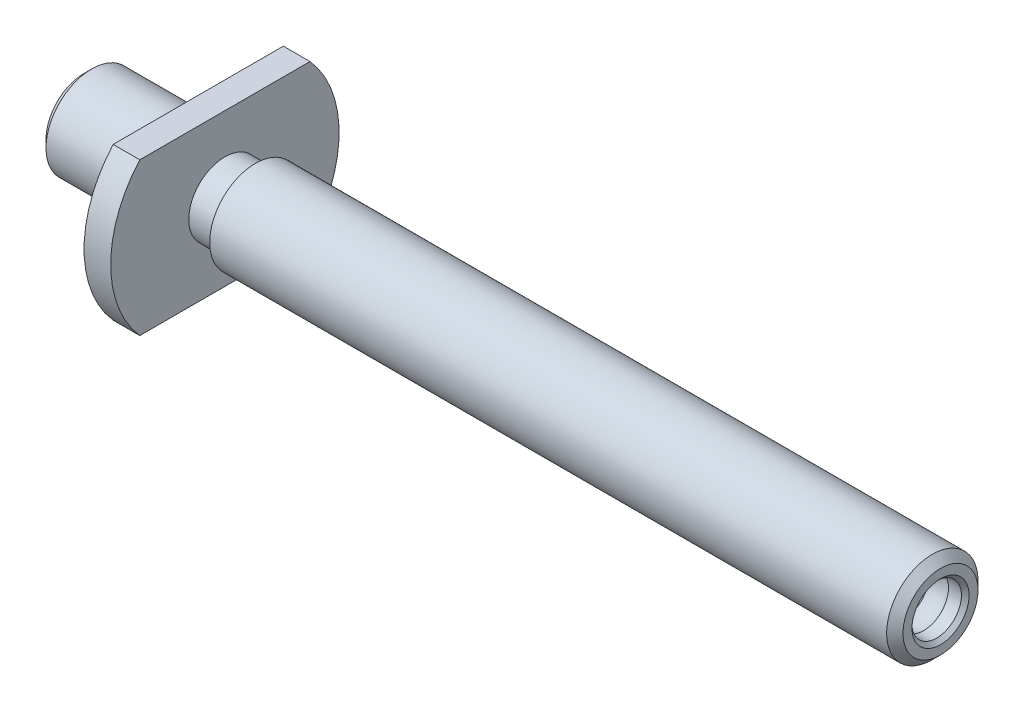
ISO-10303-21;
HEADER;
FILE_DESCRIPTION(('STEP AP214'),'2;1');
FILE_NAME('part.step','',(''),(''),'','','');
FILE_SCHEMA(('AUTOMOTIVE_DESIGN { 1 0 10303 214 1 1 1 1 }'));
ENDSEC;
DATA;
#1=APPLICATION_CONTEXT('core data for automotive mechanical design processes');
#2=APPLICATION_PROTOCOL_DEFINITION('international standard','automotive_design',2000,#1);
#3=PRODUCT_CONTEXT('',#1,'mechanical');
#4=PRODUCT('Part','Part','',(#3));
#5=PRODUCT_RELATED_PRODUCT_CATEGORY('part','',(#4));
#6=PRODUCT_DEFINITION_FORMATION('','',#4);
#7=PRODUCT_DEFINITION_CONTEXT('part definition',#1,'design');
#8=PRODUCT_DEFINITION('design','',#6,#7);
#9=PRODUCT_DEFINITION_SHAPE('','',#8);
#10=(LENGTH_UNIT() NAMED_UNIT(*) SI_UNIT(.MILLI.,.METRE.));
#11=(NAMED_UNIT(*) PLANE_ANGLE_UNIT() SI_UNIT($,.RADIAN.));
#12=(NAMED_UNIT(*) SI_UNIT($,.STERADIAN.) SOLID_ANGLE_UNIT());
#13=UNCERTAINTY_MEASURE_WITH_UNIT(LENGTH_MEASURE(1.E-05),#10,'distance_accuracy_value','');
#14=(GEOMETRIC_REPRESENTATION_CONTEXT(3) GLOBAL_UNCERTAINTY_ASSIGNED_CONTEXT((#13)) GLOBAL_UNIT_ASSIGNED_CONTEXT((#10,
#11,#12)) REPRESENTATION_CONTEXT('',''));
#15=CARTESIAN_POINT('',(0.,0.,0.));
#16=DIRECTION('',(0.,0.,1.));
#17=DIRECTION('',(1.,0.,0.));
#18=AXIS2_PLACEMENT_3D('',#15,#16,#17);
#19=CARTESIAN_POINT('',(110.6665317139,0.,0.));
#20=DIRECTION('',(1.,0.,0.));
#21=DIRECTION('',(0.,0.,-1.));
#22=AXIS2_PLACEMENT_3D('',#19,#20,#21);
#23=CYLINDRICAL_SURFACE('',#22,15.);
#24=DIRECTION('',(1.,0.,0.));
#25=VECTOR('',#24,1.);
#26=CARTESIAN_POINT('',(110.6665317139,-10.,11.1803398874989));
#27=LINE('',#26,#25);
#28=CARTESIAN_POINT('',(3.5,-10.,11.1803398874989));
#29=VERTEX_POINT('',#28);
#30=CARTESIAN_POINT('',(0.,-10.,11.1803398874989));
#31=VERTEX_POINT('',#30);
#32=EDGE_CURVE('E57',#29,#31,#27,.F.);
#33=ORIENTED_EDGE('',*,*,#32,.F.);
#34=CARTESIAN_POINT('',(3.5,0.,0.));
#35=DIRECTION('',(1.,0.,0.));
#36=DIRECTION('',(0.,0.,-1.));
#37=AXIS2_PLACEMENT_3D('',#34,#35,#36);
#38=CIRCLE('',#37,15.);
#39=CARTESIAN_POINT('',(3.5,10.,11.1803398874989));
#40=VERTEX_POINT('',#39);
#41=EDGE_CURVE('E110',#40,#29,#38,.T.);
#42=ORIENTED_EDGE('',*,*,#41,.F.);
#43=DIRECTION('',(1.,0.,0.));
#44=VECTOR('',#43,1.);
#45=CARTESIAN_POINT('',(110.6665317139,10.,11.1803398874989));
#46=LINE('',#45,#44);
#47=CARTESIAN_POINT('',(0.,10.,11.1803398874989));
#48=VERTEX_POINT('',#47);
#49=EDGE_CURVE('E102',#40,#48,#46,.F.);
#50=ORIENTED_EDGE('',*,*,#49,.T.);
#51=CARTESIAN_POINT('',(0.,0.,0.));
#52=DIRECTION('',(1.,0.,0.));
#53=DIRECTION('',(0.,0.,-1.));
#54=AXIS2_PLACEMENT_3D('',#51,#52,#53);
#55=CIRCLE('',#54,15.);
#56=EDGE_CURVE('E87',#48,#31,#55,.T.);
#57=ORIENTED_EDGE('',*,*,#56,.T.);
#58=EDGE_LOOP('',(#33,#42,#50,#57));
#59=FACE_BOUND('',#58,.T.);
#60=ADVANCED_FACE('F34',(#59),#23,.T.);
#61=CARTESIAN_POINT('',(3.5,4.75,0.));
#62=DIRECTION('',(1.,0.,0.));
#63=DIRECTION('',(0.,0.,-1.));
#64=AXIS2_PLACEMENT_3D('',#61,#62,#63);
#65=PLANE('',#64);
#66=DIRECTION('',(0.,0.,1.));
#67=VECTOR('',#66,1.);
#68=CARTESIAN_POINT('',(3.5,-10.,0.));
#69=LINE('',#68,#67);
#70=CARTESIAN_POINT('',(3.5,-10.,-11.1803398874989));
#71=VERTEX_POINT('',#70);
#72=EDGE_CURVE('E49',#71,#29,#69,.T.);
#73=ORIENTED_EDGE('',*,*,#72,.F.);
#74=CARTESIAN_POINT('',(3.5,10.,-11.1803398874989));
#75=VERTEX_POINT('',#74);
#76=EDGE_CURVE('E93',#71,#75,#38,.T.);
#77=ORIENTED_EDGE('',*,*,#76,.T.);
#78=DIRECTION('',(0.,0.,1.));
#79=VECTOR('',#78,1.);
#80=CARTESIAN_POINT('',(3.5,10.,0.));
#81=LINE('',#80,#79);
#82=EDGE_CURVE('E105',#75,#40,#81,.T.);
#83=ORIENTED_EDGE('',*,*,#82,.T.);
#84=ORIENTED_EDGE('',*,*,#41,.T.);
#85=EDGE_LOOP('',(#73,#77,#83,#84));
#86=FACE_BOUND('',#85,.T.);
#87=CARTESIAN_POINT('',(3.5,0.,0.));
#88=DIRECTION('',(1.,0.,0.));
#89=DIRECTION('',(0.,0.,-1.));
#90=AXIS2_PLACEMENT_3D('',#87,#88,#89);
#91=CIRCLE('',#90,4.75);
#92=CARTESIAN_POINT('',(3.5,0.,-4.75));
#93=VERTEX_POINT('',#92);
#94=EDGE_CURVE('E112',#93,#93,#91,.T.);
#95=ORIENTED_EDGE('',*,*,#94,.F.);
#96=EDGE_LOOP('',(#95));
#97=FACE_BOUND('',#96,.T.);
#98=ADVANCED_FACE('F170',(#86,#97),#65,.T.);
#99=DIRECTION('',(1.,0.,0.));
#100=VECTOR('',#99,1.);
#101=CARTESIAN_POINT('',(110.6665317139,-10.,-11.1803398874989));
#102=LINE('',#101,#100);
#103=CARTESIAN_POINT('',(0.,-10.,-11.1803398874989));
#104=VERTEX_POINT('',#103);
#105=EDGE_CURVE('E91',#104,#71,#102,.T.);
#106=ORIENTED_EDGE('',*,*,#105,.F.);
#107=CARTESIAN_POINT('',(0.,10.,-11.1803398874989));
#108=VERTEX_POINT('',#107);
#109=EDGE_CURVE('E79',#104,#108,#55,.T.);
#110=ORIENTED_EDGE('',*,*,#109,.T.);
#111=DIRECTION('',(1.,0.,0.));
#112=VECTOR('',#111,1.);
#113=CARTESIAN_POINT('',(110.6665317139,10.,-11.1803398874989));
#114=LINE('',#113,#112);
#115=EDGE_CURVE('E98',#108,#75,#114,.T.);
#116=ORIENTED_EDGE('',*,*,#115,.T.);
#117=ORIENTED_EDGE('',*,*,#76,.F.);
#118=EDGE_LOOP('',(#106,#110,#116,#117));
#119=FACE_BOUND('',#118,.T.);
#120=ADVANCED_FACE('F92',(#119),#23,.T.);
#121=CARTESIAN_POINT('',(0.,15.,0.));
#122=DIRECTION('',(-1.,0.,0.));
#123=DIRECTION('',(0.,0.,1.));
#124=AXIS2_PLACEMENT_3D('',#121,#122,#123);
#125=PLANE('',#124);
#126=DIRECTION('',(0.,0.,-1.));
#127=VECTOR('',#126,1.);
#128=CARTESIAN_POINT('',(0.,-10.,0.));
#129=LINE('',#128,#127);
#130=EDGE_CURVE('E11',#31,#104,#129,.T.);
#131=ORIENTED_EDGE('',*,*,#130,.F.);
#132=ORIENTED_EDGE('',*,*,#56,.F.);
#133=DIRECTION('',(0.,0.,-1.));
#134=VECTOR('',#133,1.);
#135=CARTESIAN_POINT('',(0.,10.,0.));
#136=LINE('',#135,#134);
#137=EDGE_CURVE('E42',#48,#108,#136,.T.);
#138=ORIENTED_EDGE('',*,*,#137,.T.);
#139=ORIENTED_EDGE('',*,*,#109,.F.);
#140=EDGE_LOOP('',(#131,#132,#138,#139));
#141=FACE_BOUND('',#140,.T.);
#142=CARTESIAN_POINT('',(0.,0.,0.));
#143=DIRECTION('',(1.,0.,0.));
#144=DIRECTION('',(0.,0.,-1.));
#145=AXIS2_PLACEMENT_3D('',#142,#143,#144);
#146=CIRCLE('',#145,6.);
#147=CARTESIAN_POINT('',(0.,0.,-6.));
#148=VERTEX_POINT('',#147);
#149=EDGE_CURVE('E88',#148,#148,#146,.T.);
#150=ORIENTED_EDGE('',*,*,#149,.T.);
#151=EDGE_LOOP('',(#150));
#152=FACE_BOUND('',#151,.T.);
#153=ADVANCED_FACE('F81',(#141,#152),#125,.T.);
#154=CARTESIAN_POINT('',(-15.,6.,0.));
#155=DIRECTION('',(-1.,0.,0.));
#156=DIRECTION('',(0.,0.,1.));
#157=AXIS2_PLACEMENT_3D('',#154,#155,#156);
#158=PLANE('',#157);
#159=CARTESIAN_POINT('',(-15.,0.,0.));
#160=DIRECTION('',(-1.,0.,0.));
#161=DIRECTION('',(0.,0.,1.));
#162=AXIS2_PLACEMENT_3D('',#159,#160,#161);
#163=CIRCLE('',#162,4.99999999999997);
#164=CARTESIAN_POINT('',(-15.,0.,4.99999999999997));
#165=VERTEX_POINT('',#164);
#166=EDGE_CURVE('E145',#165,#165,#163,.T.);
#167=ORIENTED_EDGE('',*,*,#166,.T.);
#168=EDGE_LOOP('',(#167));
#169=FACE_BOUND('',#168,.T.);
#170=ADVANCED_FACE('F36',(#169),#158,.T.);
#171=CARTESIAN_POINT('',(89.9167831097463,0.,0.));
#172=DIRECTION('',(1.,0.,0.));
#173=DIRECTION('',(0.,0.,-1.));
#174=AXIS2_PLACEMENT_3D('',#171,#172,#173);
#175=CONICAL_SURFACE('',#174,0.,1.02974425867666);
#176=CARTESIAN_POINT('',(91.8695801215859,0.,0.));
#177=DIRECTION('',(1.,0.,0.));
#178=DIRECTION('',(0.,0.,-1.));
#179=AXIS2_PLACEMENT_3D('',#176,#177,#178);
#180=CIRCLE('',#179,3.25);
#181=CARTESIAN_POINT('',(91.8695801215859,0.,-3.25));
#182=VERTEX_POINT('',#181);
#183=EDGE_CURVE('E139',#182,#182,#180,.T.);
#184=ORIENTED_EDGE('',*,*,#183,.T.);
#185=EDGE_LOOP('',(#184));
#186=FACE_BOUND('',#185,.T.);
#187=CARTESIAN_POINT('',(89.9167831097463,0.,0.));
#188=VERTEX_POINT('',#187);
#189=VERTEX_LOOP('',#188);
#190=FACE_BOUND('',#189,.T.);
#191=ADVANCED_FACE('F169',(#186,#190),#175,.F.);
#192=CARTESIAN_POINT('',(110.6665317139,0.,0.));
#193=DIRECTION('',(1.,0.,0.));
#194=DIRECTION('',(0.,0.,-1.));
#195=AXIS2_PLACEMENT_3D('',#192,#193,#194);
#196=CYLINDRICAL_SURFACE('',#195,3.25);
#197=CARTESIAN_POINT('',(92.7009618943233,0.,0.));
#198=DIRECTION('',(1.,0.,0.));
#199=DIRECTION('',(0.,0.,-1.));
#200=AXIS2_PLACEMENT_3D('',#197,#198,#199);
#201=CIRCLE('',#200,3.25);
#202=CARTESIAN_POINT('',(92.7009618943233,3.25,0.));
#203=VERTEX_POINT('',#202);
#204=EDGE_CURVE('E136',#203,#203,#201,.T.);
#205=ORIENTED_EDGE('',*,*,#204,.T.);
#206=EDGE_LOOP('',(#205));
#207=FACE_BOUND('',#206,.T.);
#208=ORIENTED_EDGE('',*,*,#183,.F.);
#209=EDGE_LOOP('',(#208));
#210=FACE_BOUND('',#209,.T.);
#211=ADVANCED_FACE('F208',(#207,#210),#196,.F.);
#212=CARTESIAN_POINT('',(94.,0.,0.));
#213=DIRECTION('',(1.,0.,0.));
#214=DIRECTION('',(0.,1.,0.));
#215=AXIS2_PLACEMENT_3D('',#212,#213,#214);
#216=SPHERICAL_SURFACE('',#215,3.5);
#217=CARTESIAN_POINT('',(95.2990381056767,0.,0.));
#218=DIRECTION('',(1.,0.,0.));
#219=DIRECTION('',(0.,0.,-1.));
#220=AXIS2_PLACEMENT_3D('',#217,#218,#219);
#221=CIRCLE('',#220,3.25);
#222=CARTESIAN_POINT('',(95.2990381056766,3.25,0.));
#223=VERTEX_POINT('',#222);
#224=EDGE_CURVE('E133',#223,#223,#221,.T.);
#225=CARTESIAN_POINT('',(95.2990381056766,3.25,0.));
#226=CARTESIAN_POINT('',(95.2732919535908,3.26029091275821,0.));
#227=CARTESIAN_POINT('',(95.247423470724,3.27027576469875,0.));
#228=CARTESIAN_POINT('',(95.1954565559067,3.28962798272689,0.));
#229=CARTESIAN_POINT('',(95.1693581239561,3.2989953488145,0.));
#230=CARTESIAN_POINT('',(95.1169460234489,3.3171072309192,0.));
#231=CARTESIAN_POINT('',(95.0906323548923,3.32585174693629,0.));
#232=CARTESIAN_POINT('',(95.0378046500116,3.34271300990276,0.));
#233=CARTESIAN_POINT('',(95.0112906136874,3.35082975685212,0.));
#234=CARTESIAN_POINT('',(94.9580771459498,3.36643089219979,0.));
#235=CARTESIAN_POINT('',(94.9313777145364,3.37391528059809,0.));
#236=CARTESIAN_POINT('',(94.8778085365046,3.38824747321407,0.));
#237=CARTESIAN_POINT('',(94.8509387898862,3.39509527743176,0.));
#238=CARTESIAN_POINT('',(94.7970441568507,3.40815043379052,0.));
#239=CARTESIAN_POINT('',(94.7700192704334,3.41435778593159,0.));
#240=CARTESIAN_POINT('',(94.7158296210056,3.42612853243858,0.));
#241=CARTESIAN_POINT('',(94.6886648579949,3.4316919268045,0.));
#242=CARTESIAN_POINT('',(94.6342107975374,3.44217161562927,0.));
#243=CARTESIAN_POINT('',(94.6069215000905,3.44708791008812,0.));
#244=CARTESIAN_POINT('',(94.5522337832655,3.4562706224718,0.));
#245=CARTESIAN_POINT('',(94.5248353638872,3.46053704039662,0.));
#246=CARTESIAN_POINT('',(94.469944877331,3.46841759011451,0.));
#247=CARTESIAN_POINT('',(94.442452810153,3.47203172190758,0.));
#248=CARTESIAN_POINT('',(94.3873905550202,3.47860565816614,0.));
#249=CARTESIAN_POINT('',(94.3598203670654,3.48156546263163,0.));
#250=CARTESIAN_POINT('',(94.304617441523,3.48682907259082,0.));
#251=CARTESIAN_POINT('',(94.2769847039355,3.48913287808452,0.));
#252=CARTESIAN_POINT('',(94.2216722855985,3.49308318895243,0.));
#253=CARTESIAN_POINT('',(94.193992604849,3.49472969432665,0.));
#254=CARTESIAN_POINT('',(94.138601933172,3.49736447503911,0.));
#255=CARTESIAN_POINT('',(94.1108909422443,3.49835275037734,0.));
#256=CARTESIAN_POINT('',(94.0554533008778,3.49967051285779,0.));
#257=CARTESIAN_POINT('',(94.0277266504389,3.5,0.));
#258=CARTESIAN_POINT('',(93.9722733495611,3.5,0.));
#259=CARTESIAN_POINT('',(93.9445466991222,3.49967051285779,0.));
#260=CARTESIAN_POINT('',(93.8891090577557,3.49835275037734,0.));
#261=CARTESIAN_POINT('',(93.861398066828,3.49736447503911,0.));
#262=CARTESIAN_POINT('',(93.806007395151,3.49472969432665,0.));
#263=CARTESIAN_POINT('',(93.7783277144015,3.49308318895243,0.));
#264=CARTESIAN_POINT('',(93.7230152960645,3.48913287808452,0.));
#265=CARTESIAN_POINT('',(93.6953825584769,3.48682907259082,0.));
#266=CARTESIAN_POINT('',(93.6401796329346,3.48156546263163,0.));
#267=CARTESIAN_POINT('',(93.6126094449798,3.47860565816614,0.));
#268=CARTESIAN_POINT('',(93.557547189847,3.47203172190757,0.));
#269=CARTESIAN_POINT('',(93.530055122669,3.46841759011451,0.));
#270=CARTESIAN_POINT('',(93.4751646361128,3.46053704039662,0.));
#271=CARTESIAN_POINT('',(93.4477662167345,3.4562706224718,0.));
#272=CARTESIAN_POINT('',(93.3930784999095,3.44708791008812,0.));
#273=CARTESIAN_POINT('',(93.3657892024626,3.44217161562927,0.));
#274=CARTESIAN_POINT('',(93.3113351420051,3.43169192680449,0.));
#275=CARTESIAN_POINT('',(93.2841703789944,3.42612853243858,0.));
#276=CARTESIAN_POINT('',(93.2299807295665,3.41435778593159,0.));
#277=CARTESIAN_POINT('',(93.2029558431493,3.40815043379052,0.));
#278=CARTESIAN_POINT('',(93.1490612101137,3.39509527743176,0.));
#279=CARTESIAN_POINT('',(93.1221914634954,3.38824747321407,0.));
#280=CARTESIAN_POINT('',(93.0686222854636,3.37391528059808,0.));
#281=CARTESIAN_POINT('',(93.0419228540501,3.36643089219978,0.));
#282=CARTESIAN_POINT('',(92.9887093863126,3.35082975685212,0.));
#283=CARTESIAN_POINT('',(92.9621953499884,3.34271300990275,0.));
#284=CARTESIAN_POINT('',(92.9093676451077,3.32585174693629,0.));
#285=CARTESIAN_POINT('',(92.8830539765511,3.31710723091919,0.));
#286=CARTESIAN_POINT('',(92.8306418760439,3.29899534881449,0.));
#287=CARTESIAN_POINT('',(92.8045434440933,3.28962798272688,0.));
#288=CARTESIAN_POINT('',(92.752576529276,3.27027576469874,0.));
#289=CARTESIAN_POINT('',(92.7267080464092,3.2602909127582,0.));
#290=CARTESIAN_POINT('',(92.7009618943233,3.25,0.));
#291=B_SPLINE_CURVE_WITH_KNOTS('',3,(#225,#226,#227,#228,#229,#230,#231,#232,#233,#234,#235,
#236,#237,#238,#239,#240,#241,#242,#243,#244,#245,#246,#247,#248,#249,#250,#251,#252,#253,#254,
#255,#256,#257,#258,#259,#260,#261,#262,#263,#264,#265,#266,#267,#268,#269,#270,#271,#272,#273,
#274,#275,#276,#277,#278,#279,#280,#281,#282,#283,#284,#285,#286,#287,#288,#289,#290),
.UNSPECIFIED.,.F.,.F.,(4,2,2,2,2,2,2,2,2,2,2,2,2,2,2,2,2,2,2,2,2,2,2,2,2,2,2,2,2,2,2,2,4),(0.,
0.0831779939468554,0.166355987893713,0.249533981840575,0.332711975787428,0.415889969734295,
0.499067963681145,0.582245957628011,0.665423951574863,0.748601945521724,0.831779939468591,
0.914957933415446,0.998135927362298,1.08131392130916,1.16449191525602,1.24766990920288,
1.33084790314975,1.4140258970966,1.49720389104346,1.58038188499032,1.66355987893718,
1.74673787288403,1.82991586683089,1.91309386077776,1.99627185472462,2.07944984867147,
2.16262784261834,2.24580583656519,2.32898383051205,2.41216182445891,2.49533981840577,
2.57851781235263,2.66169580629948),.UNSPECIFIED.);
#292=EDGE_CURVE('BSEAM204',#223,#203,#291,.T.);
#293=ORIENTED_EDGE('',*,*,#224,.T.);
#294=ORIENTED_EDGE('',*,*,#204,.F.);
#295=ORIENTED_EDGE('',*,*,#292,.T.);
#296=ORIENTED_EDGE('',*,*,#292,.F.);
#297=EDGE_LOOP('',(#293,#295,#294,#296));
#298=FACE_BOUND('',#297,.T.);
#299=ADVANCED_FACE('F204',(#298),#216,.F.);
#300=CARTESIAN_POINT('',(110.6665317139,0.,0.));
#301=DIRECTION('',(1.,0.,0.));
#302=DIRECTION('',(0.,0.,-1.));
#303=AXIS2_PLACEMENT_3D('',#300,#301,#302);
#304=CYLINDRICAL_SURFACE('',#303,3.25);
#305=CARTESIAN_POINT('',(97.,0.,0.));
#306=DIRECTION('',(1.,0.,0.));
#307=DIRECTION('',(0.,0.,-1.));
#308=AXIS2_PLACEMENT_3D('',#305,#306,#307);
#309=CIRCLE('',#308,3.25);
#310=CARTESIAN_POINT('',(97.,0.,-3.25));
#311=VERTEX_POINT('',#310);
#312=EDGE_CURVE('E130',#311,#311,#309,.T.);
#313=ORIENTED_EDGE('',*,*,#312,.T.);
#314=EDGE_LOOP('',(#313));
#315=FACE_BOUND('',#314,.T.);
#316=ORIENTED_EDGE('',*,*,#224,.F.);
#317=EDGE_LOOP('',(#316));
#318=FACE_BOUND('',#317,.T.);
#319=ADVANCED_FACE('F200',(#315,#318),#304,.F.);
#320=CARTESIAN_POINT('',(97.,0.,0.));
#321=DIRECTION('',(1.,0.,0.));
#322=DIRECTION('',(0.,0.,-1.));
#323=AXIS2_PLACEMENT_3D('',#320,#321,#322);
#324=CONICAL_SURFACE('',#323,3.25,0.785398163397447);
#325=CARTESIAN_POINT('',(97.5,0.,0.));
#326=DIRECTION('',(1.,0.,0.));
#327=DIRECTION('',(0.,0.,-1.));
#328=AXIS2_PLACEMENT_3D('',#325,#326,#327);
#329=CIRCLE('',#328,3.75);
#330=CARTESIAN_POINT('',(97.5,0.,-3.75));
#331=VERTEX_POINT('',#330);
#332=EDGE_CURVE('E127',#331,#331,#329,.T.);
#333=ORIENTED_EDGE('',*,*,#332,.T.);
#334=EDGE_LOOP('',(#333));
#335=FACE_BOUND('',#334,.T.);
#336=ORIENTED_EDGE('',*,*,#312,.F.);
#337=EDGE_LOOP('',(#336));
#338=FACE_BOUND('',#337,.T.);
#339=ADVANCED_FACE('F196',(#335,#338),#324,.F.);
#340=CARTESIAN_POINT('',(97.5,3.75,0.));
#341=DIRECTION('',(1.,0.,0.));
#342=DIRECTION('',(0.,0.,-1.));
#343=AXIS2_PLACEMENT_3D('',#340,#341,#342);
#344=PLANE('',#343);
#345=CARTESIAN_POINT('',(97.5,0.,0.));
#346=DIRECTION('',(1.,0.,0.));
#347=DIRECTION('',(0.,0.,-1.));
#348=AXIS2_PLACEMENT_3D('',#345,#346,#347);
#349=CIRCLE('',#348,4.92655);
#350=CARTESIAN_POINT('',(97.5,0.,-4.92655));
#351=VERTEX_POINT('',#350);
#352=EDGE_CURVE('E124',#351,#351,#349,.T.);
#353=ORIENTED_EDGE('',*,*,#352,.T.);
#354=EDGE_LOOP('',(#353));
#355=FACE_BOUND('',#354,.T.);
#356=ORIENTED_EDGE('',*,*,#332,.F.);
#357=EDGE_LOOP('',(#356));
#358=FACE_BOUND('',#357,.T.);
#359=ADVANCED_FACE('F192',(#355,#358),#344,.T.);
#360=CARTESIAN_POINT('',(97.5,0.,0.));
#361=DIRECTION('',(-1.,0.,0.));
#362=DIRECTION('',(0.,0.,1.));
#363=AXIS2_PLACEMENT_3D('',#360,#361,#362);
#364=CONICAL_SURFACE('',#363,4.92655,0.785398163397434);
#365=CARTESIAN_POINT('',(96.42655,0.,0.));
#366=DIRECTION('',(1.,0.,0.));
#367=DIRECTION('',(0.,0.,-1.));
#368=AXIS2_PLACEMENT_3D('',#365,#366,#367);
#369=CIRCLE('',#368,6.);
#370=CARTESIAN_POINT('',(96.42655,0.,-6.));
#371=VERTEX_POINT('',#370);
#372=EDGE_CURVE('E121',#371,#371,#369,.T.);
#373=ORIENTED_EDGE('',*,*,#372,.T.);
#374=EDGE_LOOP('',(#373));
#375=FACE_BOUND('',#374,.T.);
#376=ORIENTED_EDGE('',*,*,#352,.F.);
#377=EDGE_LOOP('',(#376));
#378=FACE_BOUND('',#377,.T.);
#379=ADVANCED_FACE('F188',(#375,#378),#364,.T.);
#380=CARTESIAN_POINT('',(110.6665317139,0.,0.));
#381=DIRECTION('',(1.,0.,0.));
#382=DIRECTION('',(0.,0.,-1.));
#383=AXIS2_PLACEMENT_3D('',#380,#381,#382);
#384=CYLINDRICAL_SURFACE('',#383,5.99999999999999);
#385=CARTESIAN_POINT('',(7.50000000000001,0.,0.));
#386=DIRECTION('',(1.,0.,0.));
#387=DIRECTION('',(0.,0.,-1.));
#388=AXIS2_PLACEMENT_3D('',#385,#386,#387);
#389=CIRCLE('',#388,5.99999999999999);
#390=CARTESIAN_POINT('',(7.50000000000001,0.,-5.99999999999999));
#391=VERTEX_POINT('',#390);
#392=EDGE_CURVE('E118',#391,#391,#389,.T.);
#393=ORIENTED_EDGE('',*,*,#392,.T.);
#394=EDGE_LOOP('',(#393));
#395=FACE_BOUND('',#394,.T.);
#396=ORIENTED_EDGE('',*,*,#372,.F.);
#397=EDGE_LOOP('',(#396));
#398=FACE_BOUND('',#397,.T.);
#399=ADVANCED_FACE('F184',(#395,#398),#384,.T.);
#400=CARTESIAN_POINT('',(7.5,4.75,0.));
#401=DIRECTION('',(-1.,0.,0.));
#402=DIRECTION('',(0.,0.,1.));
#403=AXIS2_PLACEMENT_3D('',#400,#401,#402);
#404=PLANE('',#403);
#405=CARTESIAN_POINT('',(7.50000000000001,0.,0.));
#406=DIRECTION('',(1.,0.,0.));
#407=DIRECTION('',(0.,0.,-1.));
#408=AXIS2_PLACEMENT_3D('',#405,#406,#407);
#409=CIRCLE('',#408,4.75);
#410=CARTESIAN_POINT('',(7.50000000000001,0.,-4.75));
#411=VERTEX_POINT('',#410);
#412=EDGE_CURVE('E115',#411,#411,#409,.T.);
#413=ORIENTED_EDGE('',*,*,#412,.T.);
#414=EDGE_LOOP('',(#413));
#415=FACE_BOUND('',#414,.T.);
#416=ORIENTED_EDGE('',*,*,#392,.F.);
#417=EDGE_LOOP('',(#416));
#418=FACE_BOUND('',#417,.T.);
#419=ADVANCED_FACE('F180',(#415,#418),#404,.T.);
#420=CARTESIAN_POINT('',(110.6665317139,0.,0.));
#421=DIRECTION('',(1.,0.,0.));
#422=DIRECTION('',(0.,0.,-1.));
#423=AXIS2_PLACEMENT_3D('',#420,#421,#422);
#424=CYLINDRICAL_SURFACE('',#423,4.75);
#425=ORIENTED_EDGE('',*,*,#94,.T.);
#426=EDGE_LOOP('',(#425));
#427=FACE_BOUND('',#426,.T.);
#428=ORIENTED_EDGE('',*,*,#412,.F.);
#429=EDGE_LOOP('',(#428));
#430=FACE_BOUND('',#429,.T.);
#431=ADVANCED_FACE('F160',(#427,#430),#424,.T.);
#432=CARTESIAN_POINT('',(110.6665317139,0.,0.));
#433=DIRECTION('',(1.,0.,0.));
#434=DIRECTION('',(0.,0.,-1.));
#435=AXIS2_PLACEMENT_3D('',#432,#433,#434);
#436=CYLINDRICAL_SURFACE('',#435,6.);
#437=CARTESIAN_POINT('',(-14.,0.,0.));
#438=DIRECTION('',(-1.,0.,0.));
#439=DIRECTION('',(0.,0.,1.));
#440=AXIS2_PLACEMENT_3D('',#437,#438,#439);
#441=CIRCLE('',#440,6.);
#442=CARTESIAN_POINT('',(-14.,0.,6.));
#443=VERTEX_POINT('',#442);
#444=EDGE_CURVE('E142',#443,#443,#441,.F.);
#445=ORIENTED_EDGE('',*,*,#444,.T.);
#446=EDGE_LOOP('',(#445));
#447=FACE_BOUND('',#446,.T.);
#448=ORIENTED_EDGE('',*,*,#149,.F.);
#449=EDGE_LOOP('',(#448));
#450=FACE_BOUND('',#449,.T.);
#451=ADVANCED_FACE('F154',(#447,#450),#436,.T.);
#452=CARTESIAN_POINT('',(-14.,0.,0.));
#453=DIRECTION('',(1.,0.,0.));
#454=DIRECTION('',(0.,0.,-1.));
#455=AXIS2_PLACEMENT_3D('',#452,#453,#454);
#456=CONICAL_SURFACE('',#455,6.,0.785398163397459);
#457=ORIENTED_EDGE('',*,*,#166,.F.);
#458=EDGE_LOOP('',(#457));
#459=FACE_BOUND('',#458,.T.);
#460=ORIENTED_EDGE('',*,*,#444,.F.);
#461=EDGE_LOOP('',(#460));
#462=FACE_BOUND('',#461,.T.);
#463=ADVANCED_FACE('F150',(#459,#462),#456,.T.);
#464=CARTESIAN_POINT('',(176.917683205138,10.,15.2232012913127));
#465=DIRECTION('',(0.,1.,0.));
#466=DIRECTION('',(0.,0.,1.));
#467=AXIS2_PLACEMENT_3D('',#464,#465,#466);
#468=PLANE('',#467);
#469=ORIENTED_EDGE('',*,*,#82,.F.);
#470=ORIENTED_EDGE('',*,*,#115,.F.);
#471=ORIENTED_EDGE('',*,*,#137,.F.);
#472=ORIENTED_EDGE('',*,*,#49,.F.);
#473=EDGE_LOOP('',(#469,#470,#471,#472));
#474=FACE_BOUND('',#473,.T.);
#475=ADVANCED_FACE('F153',(#474),#468,.T.);
#476=CARTESIAN_POINT('',(152.356317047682,-10.,15.2232012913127));
#477=DIRECTION('',(0.,1.,0.));
#478=DIRECTION('',(0.,0.,1.));
#479=AXIS2_PLACEMENT_3D('',#476,#477,#478);
#480=PLANE('',#479);
#481=ORIENTED_EDGE('',*,*,#105,.T.);
#482=ORIENTED_EDGE('',*,*,#72,.T.);
#483=ORIENTED_EDGE('',*,*,#32,.T.);
#484=ORIENTED_EDGE('',*,*,#130,.T.);
#485=EDGE_LOOP('',(#481,#482,#483,#484));
#486=FACE_BOUND('',#485,.T.);
#487=ADVANCED_FACE('F96',(#486),#480,.F.);
#488=CLOSED_SHELL('',(#60,#98,#120,#153,#170,#191,#211,#299,#319,#339,#359,#379,#399,#419,#431,
#451,#463,#475,#487));
#489=MANIFOLD_SOLID_BREP('B2',#488);
#490=ADVANCED_BREP_SHAPE_REPRESENTATION('',(#18,#489),#14);
#491=SHAPE_DEFINITION_REPRESENTATION(#9,#490);
ENDSEC;
END-ISO-10303-21;
